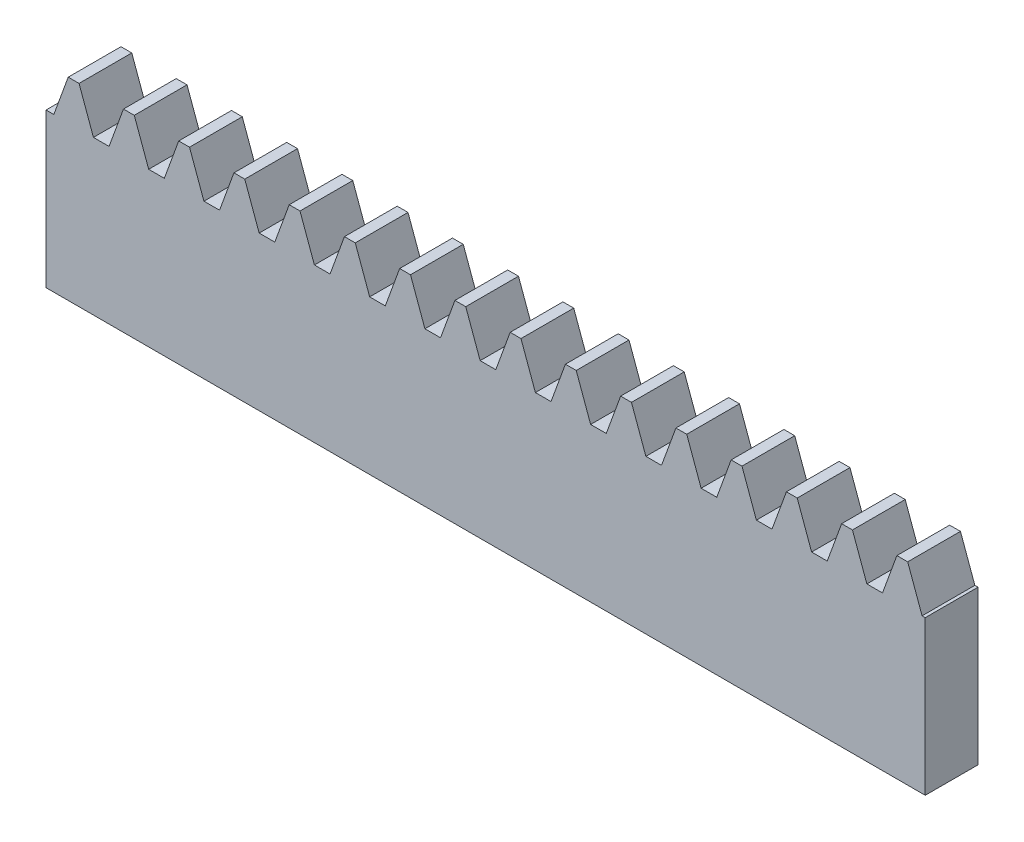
from build123d import *

# Parameters (mm, degrees)
BLANKSKE_W        = 50
BLANKSKE_H        = 11
BLANK_DEPTH       = 3
TOOTHCUTSIM_DEPTH = 52.28352562
TEETHCUTS_COUNT   = 17
TEETHCUTS_PITCH   = 3.14159265


with BuildPart() as part:
    # BlankSke → Blank (new body)
    with BuildSketch(Plane.XY):
        with Locations((25, 5.5)):
            Rectangle(BLANKSKE_W, BLANKSKE_H)
    extrude(amount=-BLANK_DEPTH)

    # TooCutSkeSim → ToothCutSim (cut, through all)
    with BuildSketch(Plane.XY):
        Polygon((0.44443537, 8.75), (-0.44443537, 8.75), (-1.272613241, 11.0254), (1.272613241, 11.0254), align=None)
    toothcutsim = extrude(amount=-TOOTHCUTSIM_DEPTH, mode=Mode.SUBTRACT)

    # TeethCuts: ToothCutSim ×17
    with Locations(*[(i * TEETHCUTS_PITCH, 0, 0) for i in range(1, TEETHCUTS_COUNT)]):
        add(toothcutsim, mode=Mode.SUBTRACT)


solid = part.part
